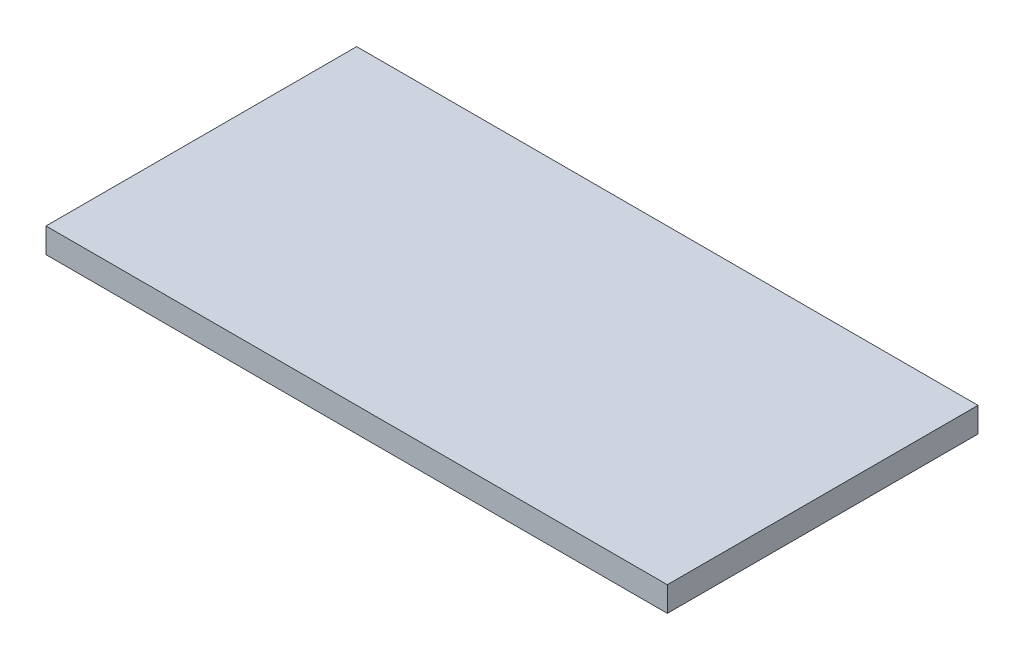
ISO-10303-21;
HEADER;
FILE_DESCRIPTION(('STEP AP214'),'2;1');
FILE_NAME('part.step','',(''),(''),'','','');
FILE_SCHEMA(('AUTOMOTIVE_DESIGN { 1 0 10303 214 1 1 1 1 }'));
ENDSEC;
DATA;
#1=APPLICATION_CONTEXT('core data for automotive mechanical design processes');
#2=APPLICATION_PROTOCOL_DEFINITION('international standard','automotive_design',2000,#1);
#3=PRODUCT_CONTEXT('',#1,'mechanical');
#4=PRODUCT('Part','Part','',(#3));
#5=PRODUCT_RELATED_PRODUCT_CATEGORY('part','',(#4));
#6=PRODUCT_DEFINITION_FORMATION('','',#4);
#7=PRODUCT_DEFINITION_CONTEXT('part definition',#1,'design');
#8=PRODUCT_DEFINITION('design','',#6,#7);
#9=PRODUCT_DEFINITION_SHAPE('','',#8);
#10=(LENGTH_UNIT() NAMED_UNIT(*) SI_UNIT(.MILLI.,.METRE.));
#11=(NAMED_UNIT(*) PLANE_ANGLE_UNIT() SI_UNIT($,.RADIAN.));
#12=(NAMED_UNIT(*) SI_UNIT($,.STERADIAN.) SOLID_ANGLE_UNIT());
#13=UNCERTAINTY_MEASURE_WITH_UNIT(LENGTH_MEASURE(1.E-05),#10,'distance_accuracy_value','');
#14=(GEOMETRIC_REPRESENTATION_CONTEXT(3) GLOBAL_UNCERTAINTY_ASSIGNED_CONTEXT((#13)) GLOBAL_UNIT_ASSIGNED_CONTEXT((#10,
#11,#12)) REPRESENTATION_CONTEXT('',''));
#15=CARTESIAN_POINT('',(0.,0.,0.));
#16=DIRECTION('',(0.,0.,1.));
#17=DIRECTION('',(1.,0.,0.));
#18=AXIS2_PLACEMENT_3D('',#15,#16,#17);
#19=CARTESIAN_POINT('',(50.0000000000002,4.,24.9999999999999));
#20=DIRECTION('',(-1.,0.,0.));
#21=DIRECTION('',(0.,0.,1.));
#22=AXIS2_PLACEMENT_3D('',#19,#20,#21);
#23=PLANE('',#22);
#24=DIRECTION('',(0.,0.,-1.));
#25=VECTOR('',#24,1.);
#26=CARTESIAN_POINT('',(50.0000000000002,0.,24.9999999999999));
#27=LINE('',#26,#25);
#28=CARTESIAN_POINT('',(50.0000000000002,0.,24.9999999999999));
#29=VERTEX_POINT('',#28);
#30=CARTESIAN_POINT('',(50.0000000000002,0.,-24.9999999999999));
#31=VERTEX_POINT('',#30);
#32=EDGE_CURVE('E97',#29,#31,#27,.T.);
#33=ORIENTED_EDGE('',*,*,#32,.T.);
#34=DIRECTION('',(0.,-1.,0.));
#35=VECTOR('',#34,1.);
#36=CARTESIAN_POINT('',(50.0000000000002,4.,-24.9999999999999));
#37=LINE('',#36,#35);
#38=CARTESIAN_POINT('',(50.0000000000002,4.,-24.9999999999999));
#39=VERTEX_POINT('',#38);
#40=EDGE_CURVE('E11',#39,#31,#37,.T.);
#41=ORIENTED_EDGE('',*,*,#40,.F.);
#42=DIRECTION('',(0.,0.,-1.));
#43=VECTOR('',#42,1.);
#44=CARTESIAN_POINT('',(50.0000000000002,4.,24.9999999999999));
#45=LINE('',#44,#43);
#46=CARTESIAN_POINT('',(50.0000000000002,4.,24.9999999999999));
#47=VERTEX_POINT('',#46);
#48=EDGE_CURVE('E85',#47,#39,#45,.T.);
#49=ORIENTED_EDGE('',*,*,#48,.F.);
#50=DIRECTION('',(0.,-1.,0.));
#51=VECTOR('',#50,1.);
#52=CARTESIAN_POINT('',(50.0000000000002,4.,24.9999999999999));
#53=LINE('',#52,#51);
#54=EDGE_CURVE('E93',#47,#29,#53,.T.);
#55=ORIENTED_EDGE('',*,*,#54,.T.);
#56=EDGE_LOOP('',(#33,#41,#49,#55));
#57=FACE_BOUND('',#56,.T.);
#58=ADVANCED_FACE('F34',(#57),#23,.F.);
#59=CARTESIAN_POINT('',(-49.9999999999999,4.,-24.9999999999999));
#60=DIRECTION('',(0.,0.,1.));
#61=DIRECTION('',(1.,0.,0.));
#62=AXIS2_PLACEMENT_3D('',#59,#60,#61);
#63=PLANE('',#62);
#64=DIRECTION('',(-1.,0.,0.));
#65=VECTOR('',#64,1.);
#66=CARTESIAN_POINT('',(-49.9999999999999,0.,-24.9999999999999));
#67=LINE('',#66,#65);
#68=CARTESIAN_POINT('',(-49.9999999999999,0.,-24.9999999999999));
#69=VERTEX_POINT('',#68);
#70=EDGE_CURVE('E89',#31,#69,#67,.T.);
#71=ORIENTED_EDGE('',*,*,#70,.T.);
#72=DIRECTION('',(0.,-1.,0.));
#73=VECTOR('',#72,1.);
#74=CARTESIAN_POINT('',(-49.9999999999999,4.,-24.9999999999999));
#75=LINE('',#74,#73);
#76=CARTESIAN_POINT('',(-49.9999999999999,4.,-24.9999999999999));
#77=VERTEX_POINT('',#76);
#78=EDGE_CURVE('E42',#77,#69,#75,.T.);
#79=ORIENTED_EDGE('',*,*,#78,.F.);
#80=DIRECTION('',(-1.,0.,0.));
#81=VECTOR('',#80,1.);
#82=CARTESIAN_POINT('',(-49.9999999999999,4.,-24.9999999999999));
#83=LINE('',#82,#81);
#84=EDGE_CURVE('E80',#39,#77,#83,.T.);
#85=ORIENTED_EDGE('',*,*,#84,.F.);
#86=ORIENTED_EDGE('',*,*,#40,.T.);
#87=EDGE_LOOP('',(#71,#79,#85,#86));
#88=FACE_BOUND('',#87,.T.);
#89=ADVANCED_FACE('F88',(#88),#63,.F.);
#90=CARTESIAN_POINT('',(-49.9999999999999,4.,24.9999999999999));
#91=DIRECTION('',(1.,0.,0.));
#92=DIRECTION('',(0.,0.,-1.));
#93=AXIS2_PLACEMENT_3D('',#90,#91,#92);
#94=PLANE('',#93);
#95=DIRECTION('',(0.,0.,1.));
#96=VECTOR('',#95,1.);
#97=CARTESIAN_POINT('',(-49.9999999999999,0.,24.9999999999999));
#98=LINE('',#97,#96);
#99=CARTESIAN_POINT('',(-49.9999999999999,0.,24.9999999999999));
#100=VERTEX_POINT('',#99);
#101=EDGE_CURVE('E67',#69,#100,#98,.T.);
#102=ORIENTED_EDGE('',*,*,#101,.T.);
#103=DIRECTION('',(0.,-1.,0.));
#104=VECTOR('',#103,1.);
#105=CARTESIAN_POINT('',(-49.9999999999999,4.,24.9999999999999));
#106=LINE('',#105,#104);
#107=CARTESIAN_POINT('',(-49.9999999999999,4.,24.9999999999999));
#108=VERTEX_POINT('',#107);
#109=EDGE_CURVE('E90',#108,#100,#106,.T.);
#110=ORIENTED_EDGE('',*,*,#109,.F.);
#111=DIRECTION('',(0.,0.,1.));
#112=VECTOR('',#111,1.);
#113=CARTESIAN_POINT('',(-49.9999999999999,4.,24.9999999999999));
#114=LINE('',#113,#112);
#115=EDGE_CURVE('E83',#77,#108,#114,.T.);
#116=ORIENTED_EDGE('',*,*,#115,.F.);
#117=ORIENTED_EDGE('',*,*,#78,.T.);
#118=EDGE_LOOP('',(#102,#110,#116,#117));
#119=FACE_BOUND('',#118,.T.);
#120=ADVANCED_FACE('F91',(#119),#94,.F.);
#121=CARTESIAN_POINT('',(-49.9999999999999,4.,24.9999999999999));
#122=DIRECTION('',(0.,0.,-1.));
#123=DIRECTION('',(-1.,0.,0.));
#124=AXIS2_PLACEMENT_3D('',#121,#122,#123);
#125=PLANE('',#124);
#126=DIRECTION('',(1.,0.,0.));
#127=VECTOR('',#126,1.);
#128=CARTESIAN_POINT('',(-49.9999999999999,0.,24.9999999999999));
#129=LINE('',#128,#127);
#130=EDGE_CURVE('E73',#100,#29,#129,.T.);
#131=ORIENTED_EDGE('',*,*,#130,.T.);
#132=ORIENTED_EDGE('',*,*,#54,.F.);
#133=DIRECTION('',(1.,0.,0.));
#134=VECTOR('',#133,1.);
#135=CARTESIAN_POINT('',(-49.9999999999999,4.,24.9999999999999));
#136=LINE('',#135,#134);
#137=EDGE_CURVE('E50',#108,#47,#136,.T.);
#138=ORIENTED_EDGE('',*,*,#137,.F.);
#139=ORIENTED_EDGE('',*,*,#109,.T.);
#140=EDGE_LOOP('',(#131,#132,#138,#139));
#141=FACE_BOUND('',#140,.T.);
#142=ADVANCED_FACE('F104',(#141),#125,.F.);
#143=CARTESIAN_POINT('',(50.0000000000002,4.,-24.9999999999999));
#144=DIRECTION('',(0.,-1.,0.));
#145=DIRECTION('',(0.,0.,-1.));
#146=AXIS2_PLACEMENT_3D('',#143,#144,#145);
#147=PLANE('',#146);
#148=ORIENTED_EDGE('',*,*,#48,.T.);
#149=ORIENTED_EDGE('',*,*,#84,.T.);
#150=ORIENTED_EDGE('',*,*,#115,.T.);
#151=ORIENTED_EDGE('',*,*,#137,.T.);
#152=EDGE_LOOP('',(#148,#149,#150,#151));
#153=FACE_BOUND('',#152,.T.);
#154=ADVANCED_FACE('F81',(#153),#147,.F.);
#155=CARTESIAN_POINT('',(50.0000000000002,0.,-24.9999999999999));
#156=DIRECTION('',(0.,-1.,0.));
#157=DIRECTION('',(0.,0.,-1.));
#158=AXIS2_PLACEMENT_3D('',#155,#156,#157);
#159=PLANE('',#158);
#160=ORIENTED_EDGE('',*,*,#32,.F.);
#161=ORIENTED_EDGE('',*,*,#130,.F.);
#162=ORIENTED_EDGE('',*,*,#101,.F.);
#163=ORIENTED_EDGE('',*,*,#70,.F.);
#164=EDGE_LOOP('',(#160,#161,#162,#163));
#165=FACE_BOUND('',#164,.T.);
#166=ADVANCED_FACE('F107',(#165),#159,.T.);
#167=CLOSED_SHELL('',(#58,#89,#120,#142,#154,#166));
#168=MANIFOLD_SOLID_BREP('B2',#167);
#169=ADVANCED_BREP_SHAPE_REPRESENTATION('',(#18,#168),#14);
#170=SHAPE_DEFINITION_REPRESENTATION(#9,#169);
ENDSEC;
END-ISO-10303-21;
